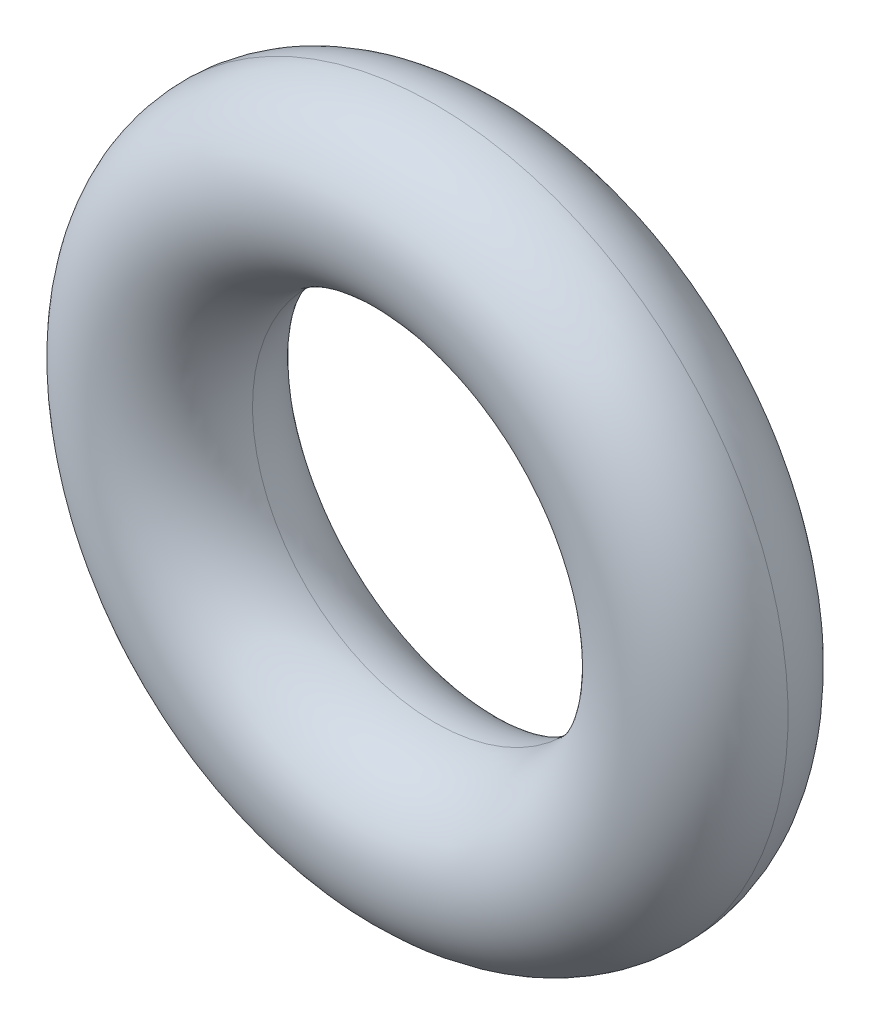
ISO-10303-21;
HEADER;
FILE_DESCRIPTION(('STEP AP214'),'2;1');
FILE_NAME('part.step','',(''),(''),'','','');
FILE_SCHEMA(('AUTOMOTIVE_DESIGN { 1 0 10303 214 1 1 1 1 }'));
ENDSEC;
DATA;
#1=APPLICATION_CONTEXT('core data for automotive mechanical design processes');
#2=APPLICATION_PROTOCOL_DEFINITION('international standard','automotive_design',2000,#1);
#3=PRODUCT_CONTEXT('',#1,'mechanical');
#4=PRODUCT('Part','Part','',(#3));
#5=PRODUCT_RELATED_PRODUCT_CATEGORY('part','',(#4));
#6=PRODUCT_DEFINITION_FORMATION('','',#4);
#7=PRODUCT_DEFINITION_CONTEXT('part definition',#1,'design');
#8=PRODUCT_DEFINITION('design','',#6,#7);
#9=PRODUCT_DEFINITION_SHAPE('','',#8);
#10=(LENGTH_UNIT() NAMED_UNIT(*) SI_UNIT(.MILLI.,.METRE.));
#11=(NAMED_UNIT(*) PLANE_ANGLE_UNIT() SI_UNIT($,.RADIAN.));
#12=(NAMED_UNIT(*) SI_UNIT($,.STERADIAN.) SOLID_ANGLE_UNIT());
#13=UNCERTAINTY_MEASURE_WITH_UNIT(LENGTH_MEASURE(1.E-05),#10,'distance_accuracy_value','');
#14=(GEOMETRIC_REPRESENTATION_CONTEXT(3) GLOBAL_UNCERTAINTY_ASSIGNED_CONTEXT((#13)) GLOBAL_UNIT_ASSIGNED_CONTEXT((#10,
#11,#12)) REPRESENTATION_CONTEXT('',''));
#15=CARTESIAN_POINT('',(0.,0.,0.));
#16=DIRECTION('',(0.,0.,1.));
#17=DIRECTION('',(1.,0.,0.));
#18=AXIS2_PLACEMENT_3D('',#15,#16,#17);
#19=CARTESIAN_POINT('',(0.,0.,0.889));
#20=DIRECTION('',(0.,0.,1.));
#21=DIRECTION('',(0.,-1.,0.));
#22=AXIS2_PLACEMENT_3D('',#19,#20,#21);
#23=TOROIDAL_SURFACE('',#22,2.794,0.889);
#24=CARTESIAN_POINT('',(0.,0.,0.889));
#25=DIRECTION('',(0.,0.,1.));
#26=DIRECTION('',(0.,-1.,0.));
#27=AXIS2_PLACEMENT_3D('',#24,#25,#26);
#28=CIRCLE('',#27,1.905);
#29=CARTESIAN_POINT('',(0.,-1.905,0.889));
#30=VERTEX_POINT('',#29);
#31=EDGE_CURVE('E19',#30,#30,#28,.T.);
#32=ORIENTED_EDGE('',*,*,#31,.F.);
#33=EDGE_LOOP('',(#32));
#34=FACE_BOUND('',#33,.T.);
#35=CARTESIAN_POINT('',(0.,0.,0.889));
#36=DIRECTION('',(0.,0.,-1.));
#37=DIRECTION('',(0.,1.,0.));
#38=AXIS2_PLACEMENT_3D('',#35,#36,#37);
#39=CIRCLE('',#38,3.683);
#40=CARTESIAN_POINT('',(0.,3.683,0.889));
#41=VERTEX_POINT('',#40);
#42=EDGE_CURVE('E9',#41,#41,#39,.T.);
#43=ORIENTED_EDGE('',*,*,#42,.F.);
#44=EDGE_LOOP('',(#43));
#45=FACE_BOUND('',#44,.T.);
#46=ADVANCED_FACE('F13',(#34,#45),#23,.T.);
#47=ORIENTED_EDGE('',*,*,#42,.T.);
#48=EDGE_LOOP('',(#47));
#49=FACE_BOUND('',#48,.T.);
#50=ORIENTED_EDGE('',*,*,#31,.T.);
#51=EDGE_LOOP('',(#50));
#52=FACE_BOUND('',#51,.T.);
#53=ADVANCED_FACE('F15',(#49,#52),#23,.T.);
#54=CLOSED_SHELL('',(#46,#53));
#55=MANIFOLD_SOLID_BREP('B1',#54);
#56=ADVANCED_BREP_SHAPE_REPRESENTATION('',(#18,#55),#14);
#57=SHAPE_DEFINITION_REPRESENTATION(#9,#56);
ENDSEC;
END-ISO-10303-21;
